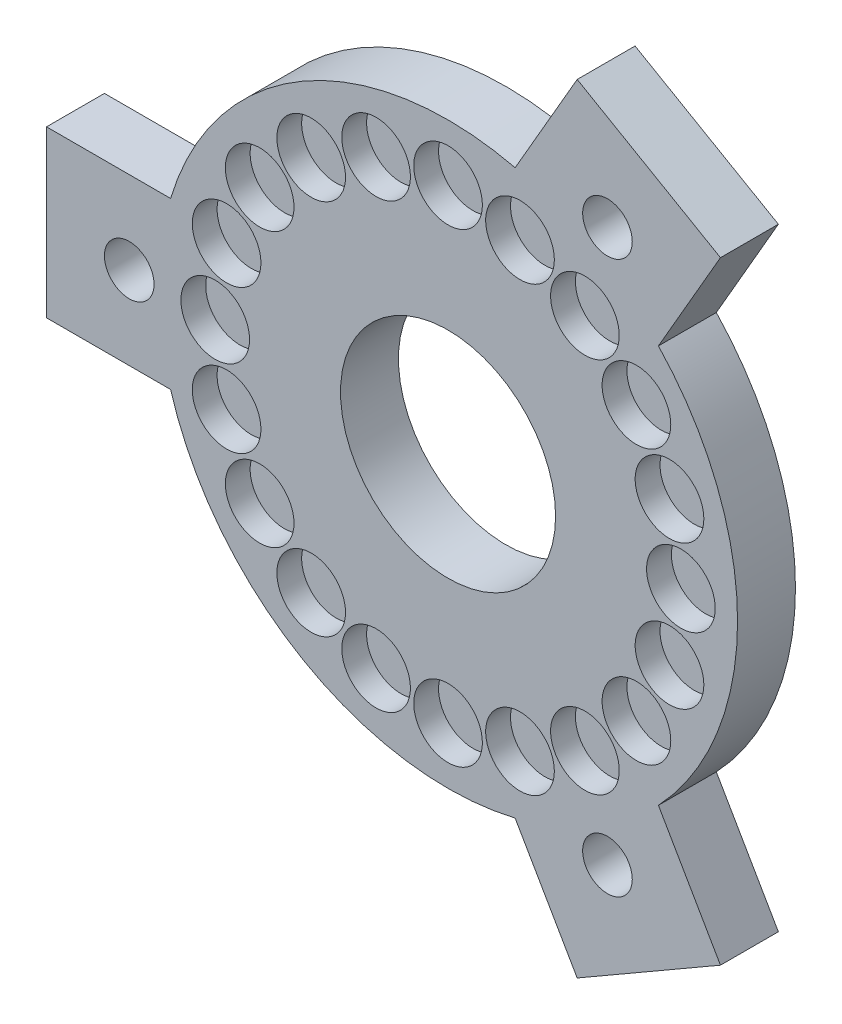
from build123d import *

# Parameters (mm, degrees)
SKIZZE1_R                       = 35
AUFSATZ_LINEAR_AUSTRAGEN3_DEPTH = 7
SKIZZE3_R                       = 4.15
SCHNITT_LINEAR_AUSTRAGEN1_DEPTH = 3
SCHNITT_LINEAR_AUSTRAGEN2_REACH = 51.99
SKIZZE4_R                       = 13
SKIZZE6_W                       = 15
SKIZZE6_H                       = 20
AUFSATZ_LINEAR_AUSTRAGEN4_DEPTH = 7
SCHNITT_LINEAR_AUSTRAGEN5_REACH = 69.954
SKIZZE9_R                       = 3


with BuildPart() as part:
    # Skizze1 → Aufsatz-Linear austragen3 (new body)
    with BuildSketch(Plane.XY):
        Circle(SKIZZE1_R)
    extrude(amount=AUFSATZ_LINEAR_AUSTRAGEN3_DEPTH)

    # Skizze3 → Schnitt-Linear austragen1 (cut)
    with BuildSketch(Plane.XY.offset(7)):
        with Locations((0, 28.15)):
            Circle(SKIZZE3_R)
        with Locations((8.698828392, 26.772240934)):
            Circle(SKIZZE3_R)
        with Locations((16.546154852, 22.773828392)):
            Circle(SKIZZE3_R)
        with Locations((22.773828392, 16.546154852)):
            Circle(SKIZZE3_R)
        with Locations((26.772240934, 8.698828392)):
            Circle(SKIZZE3_R)
        with Locations((28.15, 0)):
            Circle(SKIZZE3_R)
        with Locations((26.772240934, -8.698828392)):
            Circle(SKIZZE3_R)
        with Locations((22.773828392, -16.546154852)):
            Circle(SKIZZE3_R)
        with Locations((16.546154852, -22.773828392)):
            Circle(SKIZZE3_R)
        with Locations((8.698828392, -26.772240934)):
            Circle(SKIZZE3_R)
        with Locations((0, -28.15)):
            Circle(SKIZZE3_R)
        with Locations((-8.698828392, -26.772240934)):
            Circle(SKIZZE3_R)
        with Locations((-16.546154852, -22.773828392)):
            Circle(SKIZZE3_R)
        with Locations((-22.773828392, -16.546154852)):
            Circle(SKIZZE3_R)
        with Locations((-26.772240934, -8.698828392)):
            Circle(SKIZZE3_R)
        with Locations((-28.15, 0)):
            Circle(SKIZZE3_R)
        with Locations((-26.772240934, 8.698828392)):
            Circle(SKIZZE3_R)
        with Locations((-22.773828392, 16.546154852)):
            Circle(SKIZZE3_R)
        with Locations((-16.546154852, 22.773828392)):
            Circle(SKIZZE3_R)
        with Locations((-8.698828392, 26.772240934)):
            Circle(SKIZZE3_R)
    extrude(amount=-SCHNITT_LINEAR_AUSTRAGEN1_DEPTH, mode=Mode.SUBTRACT)

    # Skizze4 → Schnitt-Linear austragen2 (cut, up to next)
    with BuildSketch(Plane.XY.offset(7), mode=Mode.PRIVATE) as schnitt_linear_austragen2_sk1:
        Circle(SKIZZE4_R)
    schnitt_linear_austragen2_tool1 = extrude(schnitt_linear_austragen2_sk1.sketch, amount=-SCHNITT_LINEAR_AUSTRAGEN2_REACH, mode=Mode.PRIVATE) & part.part
    add(schnitt_linear_austragen2_tool1.solids().sort_by_distance((0, 0, 7))[0], mode=Mode.SUBTRACT)

    # Skizze6 → Aufsatz-Linear austragen4 (add)
    with BuildSketch(Plane(origin=(0, 0, 0), x_dir=(-1, 0, 0), z_dir=(0, 0, -1))):
        Polygon((-15.610255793, -47.037756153), (-32.930763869, -37.037756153), (-25.430763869, -24.047375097), (-8.110255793, -34.047375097), align=None)
        with Locations((41.041019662, 0)):
            Rectangle(SKIZZE6_W, SKIZZE6_H)
        Polygon((-32.930763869, 37.037756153), (-15.610255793, 47.037756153), (-8.110255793, 34.047375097), (-25.430763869, 24.047375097), align=None)
    extrude(amount=-AUFSATZ_LINEAR_AUSTRAGEN4_DEPTH)

    # Skizze9 → Schnitt-Linear austragen5 (cut, up to next)
    with BuildSketch(Plane(origin=(0, 0, 0), x_dir=(-1, 0, 0), z_dir=(0, 0, -1)), mode=Mode.PRIVATE) as schnitt_linear_austragen5_sk1:
        with Locations((38.541019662, 0)):
            Circle(SKIZZE9_R)
    schnitt_linear_austragen5_tool1 = extrude(schnitt_linear_austragen5_sk1.sketch, amount=-SCHNITT_LINEAR_AUSTRAGEN5_REACH, mode=Mode.PRIVATE) & part.part
    # Skizze9 → Schnitt-Linear austragen5 (cut, up to next)
    with BuildSketch(Plane(origin=(0, 0, 0), x_dir=(-1, 0, 0), z_dir=(0, 0, -1)), mode=Mode.PRIVATE) as schnitt_linear_austragen5_sk2:
        with Locations((-19.270509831, -33.377502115)):
            Circle(SKIZZE9_R)
    schnitt_linear_austragen5_tool2 = extrude(schnitt_linear_austragen5_sk2.sketch, amount=-SCHNITT_LINEAR_AUSTRAGEN5_REACH, mode=Mode.PRIVATE) & part.part
    # Skizze9 → Schnitt-Linear austragen5 (cut, up to next)
    with BuildSketch(Plane(origin=(0, 0, 0), x_dir=(-1, 0, 0), z_dir=(0, 0, -1)), mode=Mode.PRIVATE) as schnitt_linear_austragen5_sk3:
        with Locations((-19.270509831, 33.377502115)):
            Circle(SKIZZE9_R)
    schnitt_linear_austragen5_tool3 = extrude(schnitt_linear_austragen5_sk3.sketch, amount=-SCHNITT_LINEAR_AUSTRAGEN5_REACH, mode=Mode.PRIVATE) & part.part
    add(schnitt_linear_austragen5_tool1.solids().sort_by_distance((-38.54102, 0, 0))[0], mode=Mode.SUBTRACT)
    add(schnitt_linear_austragen5_tool2.solids().sort_by_distance((19.27051, -33.377502, 0))[0], mode=Mode.SUBTRACT)
    add(schnitt_linear_austragen5_tool3.solids().sort_by_distance((19.27051, 33.377502, 0))[0], mode=Mode.SUBTRACT)


solid = part.part
